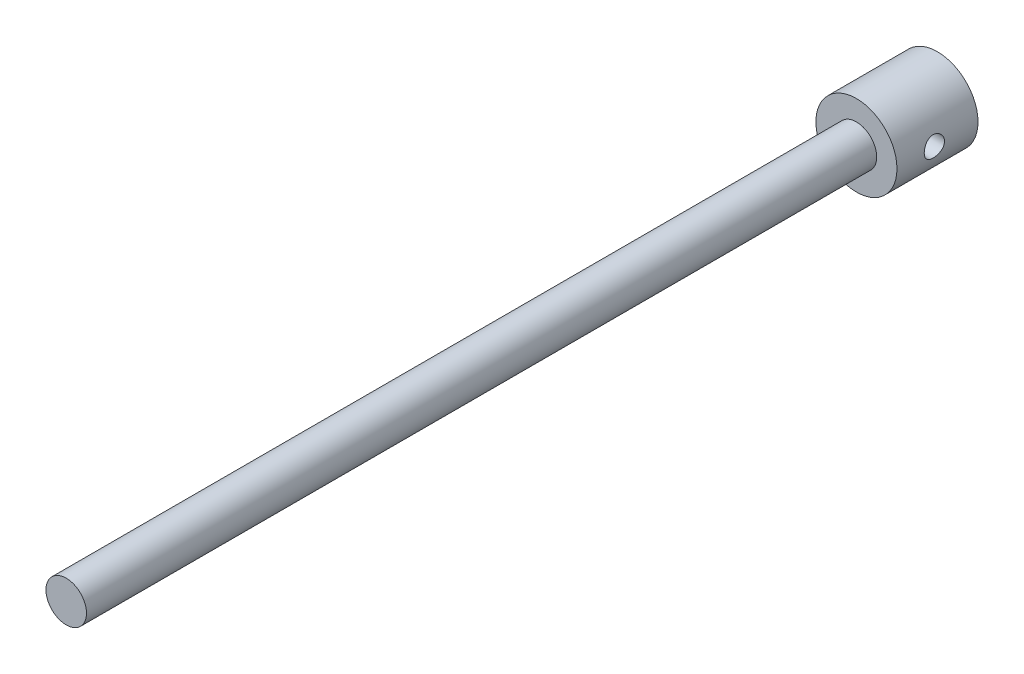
from build123d import *

# Parameters (mm, degrees)
SKETCH1_R               = 25.4
EXTRUDE1_DEPTH          = 50.8
SKETCH2_R               = 12.7
EXTRUDE2_DEPTH          = 495.3
CUT_EXTRUDE1_DEPTH      = 548.280120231
CUT_EXTRUDE1_DEPTH_BACK = 548.280120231
SKETCH3_R               = 6.35


with BuildPart() as part:
    # Sketch1 → Extrude1 (new body)
    with BuildSketch(Plane.XY):
        Circle(SKETCH1_R)
    extrude(amount=EXTRUDE1_DEPTH)

    # Sketch2 → Extrude2 (add)
    with BuildSketch(Plane.XY.offset(50.8)):
        Circle(SKETCH2_R)
    extrude(amount=EXTRUDE2_DEPTH)

    # Sketch3 → Cut-Extrude1 (cut, two sides: drawn at the far end of the back side and taken through both)
    with BuildSketch(Plane(origin=(0, 0, 0), x_dir=(0, 0, -1), z_dir=(1, 0, 0)).offset(-CUT_EXTRUDE1_DEPTH_BACK)):
        with Locations((-27.347285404, 0)):
            Circle(SKETCH3_R)
    extrude(amount=CUT_EXTRUDE1_DEPTH + CUT_EXTRUDE1_DEPTH_BACK, mode=Mode.SUBTRACT)


solid = part.part
